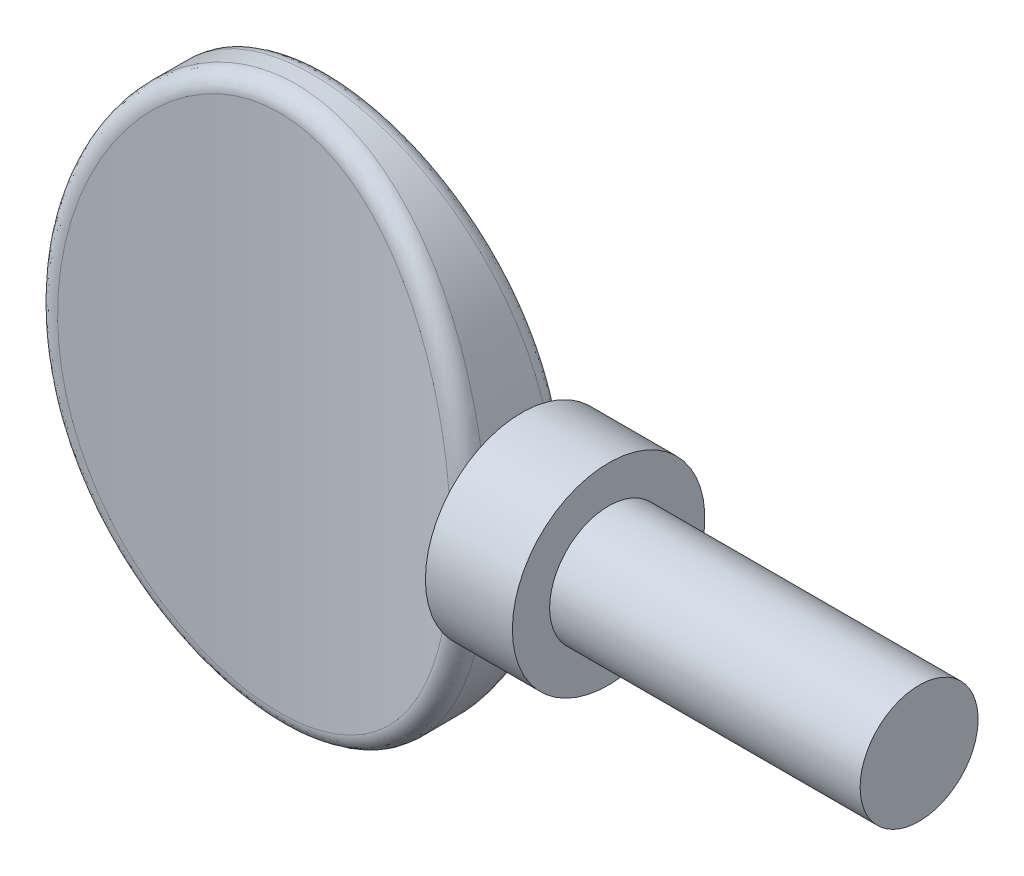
from build123d import *

# Parameters (mm, degrees)
SKETCH1_RX              = 11.303
SKETCH1_RY              = 8.889999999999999
EXTRUDE1_DEPTH          = 2.286
CUT_EXTRUDE1_DEPTH      = 15.560759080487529
CUT_EXTRUDE1_DEPTH_BACK = 15.560759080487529
SKETCH2_OUTSIDE_W       = 25.603999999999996
SKETCH2_OUTSIDE_H       = 12.396
FILLET3_R               = 0.6773333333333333


with BuildPart() as part:
    # Sketch1 → Extrude1 (new, symmetric)
    with BuildSketch(Plane.XY):
        with Locations(Location((0, 0), (0, 0, 90))):
            Ellipse(SKETCH1_RX, SKETCH1_RY)
    extrude(amount=EXTRUDE1_DEPTH, both=True)

    # Sketch2 outside → Cut-Extrude1 (cut, two sides: drawn at the far end of the back side and taken through both)
    with BuildSketch(Plane(origin=(0, 0, 0), x_dir=(1, 0, 0), z_dir=(0, 1, 0)).offset(-CUT_EXTRUDE1_DEPTH_BACK)):
        Rectangle(SKETCH2_OUTSIDE_W, SKETCH2_OUTSIDE_H)
        with BuildLine():
            Line((-8.889999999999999, 2.286), (-8.889999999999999, -2.286))
            ThreePointArc((-8.889999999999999, -2.286), (1.94e-15, -1.0159999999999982), (8.889999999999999, -2.286))
            Line((8.889999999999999, -2.286), (8.889999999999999, 2.286))
            ThreePointArc((8.889999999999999, 2.286), (1.94e-15, 1.0159999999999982), (-8.889999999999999, 2.286))
        make_face(mode=Mode.SUBTRACT)
    extrude(amount=CUT_EXTRUDE1_DEPTH + CUT_EXTRUDE1_DEPTH_BACK, mode=Mode.SUBTRACT)

    # Fillet3
    fillet3_edges = [part.edges().sort_by_distance(p)[0] for p in [
        (-6.499256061e-08, -11.302999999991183, 1.0159999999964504),
        (8.835220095e-08, -11.302999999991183, -1.0159999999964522),
    ]]
    fillet(fillet3_edges, radius=FILLET3_R)

    # Sketch3 → Revolve1 (revolve)
    with BuildSketch(Plane(origin=(0, 0, 0), x_dir=(1, 0, 0), z_dir=(0, 1, 0)), mode=Mode.PRIVATE) as revolve1_sk:
        with BuildLine():
            Line((12.445999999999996, 3.9369999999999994), (12.445999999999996, 2.413))
            Line((12.445999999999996, 2.413), (25.145999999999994, 2.413))
            Line((25.145999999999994, 2.413), (25.145999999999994, 0))
            Line((25.145999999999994, 0), (7.236423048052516, 0))
            Line((7.236423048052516, 0), (7.236423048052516, 1.8516557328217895))
            ThreePointArc((7.236423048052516, 1.8516557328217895), (8.426438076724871, 2.6063068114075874), (8.889999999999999, 3.9370000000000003))
            Line((8.889999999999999, 3.9370000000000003), (12.445999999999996, 3.9369999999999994))
        make_face()
    revolve(revolve1_sk.sketch.rotate(Axis((0, 0, 0), (1, 0, 0)), 180), axis=Axis((0, 0, 0), (1, 0, 0)))


solid = part.part
